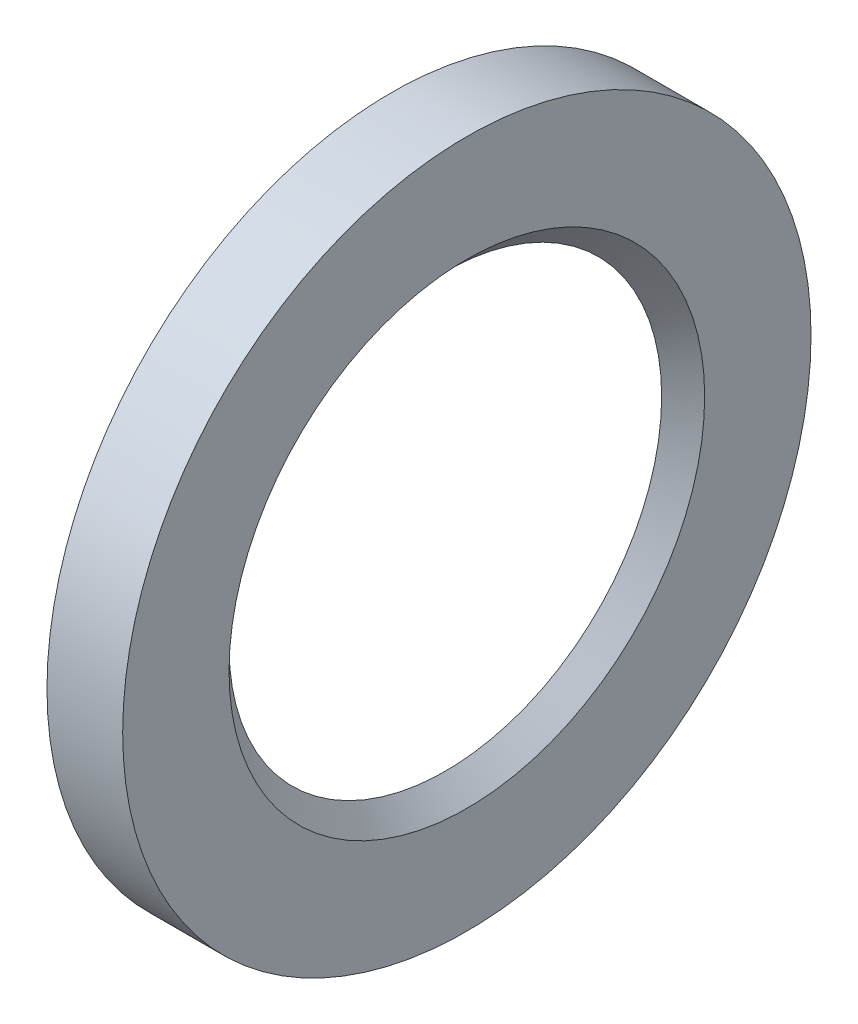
ISO-10303-21;
HEADER;
FILE_DESCRIPTION(('STEP AP214'),'2;1');
FILE_NAME('part.step','',(''),(''),'','','');
FILE_SCHEMA(('AUTOMOTIVE_DESIGN { 1 0 10303 214 1 1 1 1 }'));
ENDSEC;
DATA;
#1=APPLICATION_CONTEXT('core data for automotive mechanical design processes');
#2=APPLICATION_PROTOCOL_DEFINITION('international standard','automotive_design',2000,#1);
#3=PRODUCT_CONTEXT('',#1,'mechanical');
#4=PRODUCT('Part','Part','',(#3));
#5=PRODUCT_RELATED_PRODUCT_CATEGORY('part','',(#4));
#6=PRODUCT_DEFINITION_FORMATION('','',#4);
#7=PRODUCT_DEFINITION_CONTEXT('part definition',#1,'design');
#8=PRODUCT_DEFINITION('design','',#6,#7);
#9=PRODUCT_DEFINITION_SHAPE('','',#8);
#10=(LENGTH_UNIT() NAMED_UNIT(*) SI_UNIT(.MILLI.,.METRE.));
#11=(NAMED_UNIT(*) PLANE_ANGLE_UNIT() SI_UNIT($,.RADIAN.));
#12=(NAMED_UNIT(*) SI_UNIT($,.STERADIAN.) SOLID_ANGLE_UNIT());
#13=UNCERTAINTY_MEASURE_WITH_UNIT(LENGTH_MEASURE(1.E-05),#10,'distance_accuracy_value','');
#14=(GEOMETRIC_REPRESENTATION_CONTEXT(3) GLOBAL_UNCERTAINTY_ASSIGNED_CONTEXT((#13)) GLOBAL_UNIT_ASSIGNED_CONTEXT((#10,
#11,#12)) REPRESENTATION_CONTEXT('',''));
#15=CARTESIAN_POINT('',(0.,0.,0.));
#16=DIRECTION('',(0.,0.,1.));
#17=DIRECTION('',(1.,0.,0.));
#18=AXIS2_PLACEMENT_3D('',#15,#16,#17);
#19=CARTESIAN_POINT('',(0.,0.,0.));
#20=DIRECTION('',(1.,0.,0.));
#21=DIRECTION('',(0.,0.,-1.));
#22=AXIS2_PLACEMENT_3D('',#19,#20,#21);
#23=CONICAL_SURFACE('',#22,7.9819,0.785398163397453);
#24=CARTESIAN_POINT('',(0.79375,0.,0.));
#25=DIRECTION('',(-1.,0.,0.));
#26=DIRECTION('',(0.,0.,1.));
#27=AXIS2_PLACEMENT_3D('',#24,#25,#26);
#28=CIRCLE('',#27,8.77565000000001);
#29=CARTESIAN_POINT('',(0.79375,0.,8.77565000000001));
#30=VERTEX_POINT('',#29);
#31=EDGE_CURVE('E52',#30,#30,#28,.T.);
#32=ORIENTED_EDGE('',*,*,#31,.F.);
#33=EDGE_LOOP('',(#32));
#34=FACE_BOUND('',#33,.T.);
#35=CARTESIAN_POINT('',(0.,0.,0.));
#36=DIRECTION('',(-1.,0.,0.));
#37=DIRECTION('',(0.,0.,1.));
#38=AXIS2_PLACEMENT_3D('',#35,#36,#37);
#39=CIRCLE('',#38,7.9819);
#40=CARTESIAN_POINT('',(0.,0.,7.9819));
#41=VERTEX_POINT('',#40);
#42=EDGE_CURVE('E10',#41,#41,#39,.T.);
#43=ORIENTED_EDGE('',*,*,#42,.T.);
#44=EDGE_LOOP('',(#43));
#45=FACE_BOUND('',#44,.T.);
#46=ADVANCED_FACE('F30',(#34,#45),#23,.F.);
#47=CARTESIAN_POINT('',(0.,7.9819,0.));
#48=DIRECTION('',(1.,0.,0.));
#49=DIRECTION('',(0.,0.,-1.));
#50=AXIS2_PLACEMENT_3D('',#47,#48,#49);
#51=PLANE('',#50);
#52=ORIENTED_EDGE('',*,*,#42,.F.);
#53=EDGE_LOOP('',(#52));
#54=FACE_BOUND('',#53,.T.);
#55=CARTESIAN_POINT('',(0.,0.,0.));
#56=DIRECTION('',(-1.,0.,0.));
#57=DIRECTION('',(0.,0.,1.));
#58=AXIS2_PLACEMENT_3D('',#55,#56,#57);
#59=CIRCLE('',#58,11.2);
#60=CARTESIAN_POINT('',(0.,0.,11.2));
#61=VERTEX_POINT('',#60);
#62=EDGE_CURVE('E36',#61,#61,#59,.T.);
#63=ORIENTED_EDGE('',*,*,#62,.T.);
#64=EDGE_LOOP('',(#63));
#65=FACE_BOUND('',#64,.T.);
#66=ADVANCED_FACE('F59',(#54,#65),#51,.F.);
#67=CARTESIAN_POINT('',(0.,0.,0.));
#68=DIRECTION('',(-1.,0.,0.));
#69=DIRECTION('',(0.,0.,1.));
#70=AXIS2_PLACEMENT_3D('',#67,#68,#69);
#71=CYLINDRICAL_SURFACE('',#70,11.2);
#72=ORIENTED_EDGE('',*,*,#62,.F.);
#73=EDGE_LOOP('',(#72));
#74=FACE_BOUND('',#73,.T.);
#75=CARTESIAN_POINT('',(-2.,0.,0.));
#76=DIRECTION('',(-1.,0.,0.));
#77=DIRECTION('',(0.,0.,1.));
#78=AXIS2_PLACEMENT_3D('',#75,#76,#77);
#79=CIRCLE('',#78,11.2);
#80=CARTESIAN_POINT('',(-2.,0.,11.2));
#81=VERTEX_POINT('',#80);
#82=EDGE_CURVE('E40',#81,#81,#79,.T.);
#83=ORIENTED_EDGE('',*,*,#82,.T.);
#84=EDGE_LOOP('',(#83));
#85=FACE_BOUND('',#84,.T.);
#86=ADVANCED_FACE('F63',(#74,#85),#71,.F.);
#87=CARTESIAN_POINT('',(-2.,12.7,0.));
#88=DIRECTION('',(1.,0.,0.));
#89=DIRECTION('',(0.,0.,-1.));
#90=AXIS2_PLACEMENT_3D('',#87,#88,#89);
#91=PLANE('',#90);
#92=ORIENTED_EDGE('',*,*,#82,.F.);
#93=EDGE_LOOP('',(#92));
#94=FACE_BOUND('',#93,.T.);
#95=CARTESIAN_POINT('',(-2.,0.,0.));
#96=DIRECTION('',(-1.,0.,0.));
#97=DIRECTION('',(0.,0.,1.));
#98=AXIS2_PLACEMENT_3D('',#95,#96,#97);
#99=CIRCLE('',#98,12.7);
#100=CARTESIAN_POINT('',(-2.,0.,12.7));
#101=VERTEX_POINT('',#100);
#102=EDGE_CURVE('E44',#101,#101,#99,.T.);
#103=ORIENTED_EDGE('',*,*,#102,.T.);
#104=EDGE_LOOP('',(#103));
#105=FACE_BOUND('',#104,.T.);
#106=ADVANCED_FACE('F68',(#94,#105),#91,.F.);
#107=CARTESIAN_POINT('',(0.,0.,0.));
#108=DIRECTION('',(-1.,0.,0.));
#109=DIRECTION('',(0.,0.,1.));
#110=AXIS2_PLACEMENT_3D('',#107,#108,#109);
#111=CYLINDRICAL_SURFACE('',#110,12.7);
#112=ORIENTED_EDGE('',*,*,#102,.F.);
#113=EDGE_LOOP('',(#112));
#114=FACE_BOUND('',#113,.T.);
#115=CARTESIAN_POINT('',(0.79375,0.,0.));
#116=DIRECTION('',(-1.,0.,0.));
#117=DIRECTION('',(0.,0.,1.));
#118=AXIS2_PLACEMENT_3D('',#115,#116,#117);
#119=CIRCLE('',#118,12.7);
#120=CARTESIAN_POINT('',(0.79375,0.,12.7));
#121=VERTEX_POINT('',#120);
#122=EDGE_CURVE('E49',#121,#121,#119,.T.);
#123=ORIENTED_EDGE('',*,*,#122,.T.);
#124=EDGE_LOOP('',(#123));
#125=FACE_BOUND('',#124,.T.);
#126=ADVANCED_FACE('F74',(#114,#125),#111,.T.);
#127=CARTESIAN_POINT('',(0.79375,12.7,0.));
#128=DIRECTION('',(-1.,0.,0.));
#129=DIRECTION('',(0.,0.,1.));
#130=AXIS2_PLACEMENT_3D('',#127,#128,#129);
#131=PLANE('',#130);
#132=ORIENTED_EDGE('',*,*,#122,.F.);
#133=EDGE_LOOP('',(#132));
#134=FACE_BOUND('',#133,.T.);
#135=ORIENTED_EDGE('',*,*,#31,.T.);
#136=EDGE_LOOP('',(#135));
#137=FACE_BOUND('',#136,.T.);
#138=ADVANCED_FACE('F56',(#134,#137),#131,.F.);
#139=CLOSED_SHELL('',(#46,#66,#86,#106,#126,#138));
#140=MANIFOLD_SOLID_BREP('B2',#139);
#141=ADVANCED_BREP_SHAPE_REPRESENTATION('',(#18,#140),#14);
#142=SHAPE_DEFINITION_REPRESENTATION(#9,#141);
ENDSEC;
END-ISO-10303-21;
